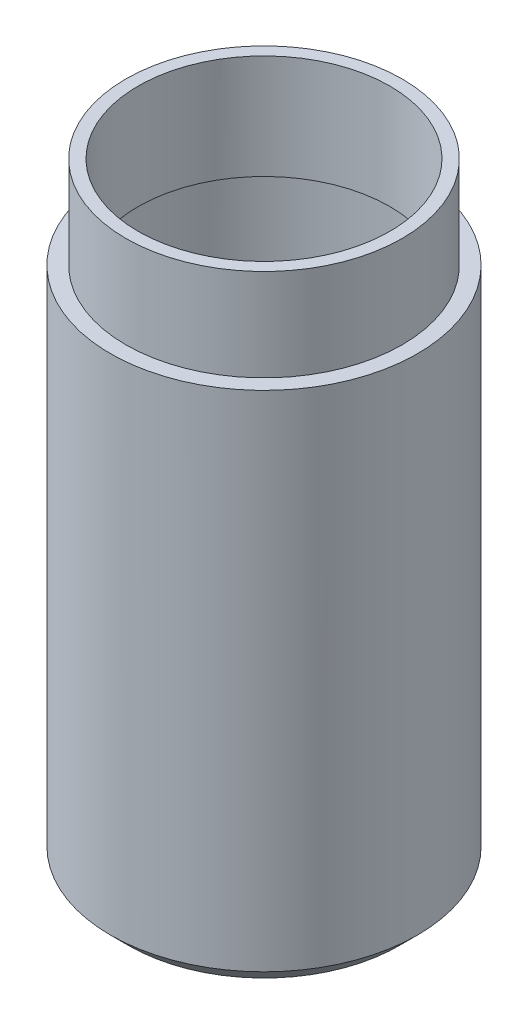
ISO-10303-21;
HEADER;
FILE_DESCRIPTION(('STEP AP214'),'2;1');
FILE_NAME('part.step','',(''),(''),'','','');
FILE_SCHEMA(('AUTOMOTIVE_DESIGN { 1 0 10303 214 1 1 1 1 }'));
ENDSEC;
DATA;
#1=APPLICATION_CONTEXT('core data for automotive mechanical design processes');
#2=APPLICATION_PROTOCOL_DEFINITION('international standard','automotive_design',2000,#1);
#3=PRODUCT_CONTEXT('',#1,'mechanical');
#4=PRODUCT('Part','Part','',(#3));
#5=PRODUCT_RELATED_PRODUCT_CATEGORY('part','',(#4));
#6=PRODUCT_DEFINITION_FORMATION('','',#4);
#7=PRODUCT_DEFINITION_CONTEXT('part definition',#1,'design');
#8=PRODUCT_DEFINITION('design','',#6,#7);
#9=PRODUCT_DEFINITION_SHAPE('','',#8);
#10=(LENGTH_UNIT() NAMED_UNIT(*) SI_UNIT(.MILLI.,.METRE.));
#11=(NAMED_UNIT(*) PLANE_ANGLE_UNIT() SI_UNIT($,.RADIAN.));
#12=(NAMED_UNIT(*) SI_UNIT($,.STERADIAN.) SOLID_ANGLE_UNIT());
#13=UNCERTAINTY_MEASURE_WITH_UNIT(LENGTH_MEASURE(1.E-05),#10,'distance_accuracy_value','');
#14=(GEOMETRIC_REPRESENTATION_CONTEXT(3) GLOBAL_UNCERTAINTY_ASSIGNED_CONTEXT((#13)) GLOBAL_UNIT_ASSIGNED_CONTEXT((#10,
#11,#12)) REPRESENTATION_CONTEXT('',''));
#15=CARTESIAN_POINT('',(0.,0.,0.));
#16=DIRECTION('',(0.,0.,1.));
#17=DIRECTION('',(1.,0.,0.));
#18=AXIS2_PLACEMENT_3D('',#15,#16,#17);
#19=CARTESIAN_POINT('',(0.,0.,0.));
#20=DIRECTION('',(0.,1.,0.));
#21=DIRECTION('',(0.,0.,1.));
#22=AXIS2_PLACEMENT_3D('',#19,#20,#21);
#23=PLANE('',#22);
#24=CARTESIAN_POINT('',(0.,0.,0.));
#25=DIRECTION('',(0.,1.,0.));
#26=DIRECTION('',(0.,0.,1.));
#27=AXIS2_PLACEMENT_3D('',#24,#25,#26);
#28=CIRCLE('',#27,22.);
#29=CARTESIAN_POINT('',(0.,0.,22.));
#30=VERTEX_POINT('',#29);
#31=EDGE_CURVE('E45',#30,#30,#28,.F.);
#32=ORIENTED_EDGE('',*,*,#31,.T.);
#33=EDGE_LOOP('',(#32));
#34=FACE_BOUND('',#33,.T.);
#35=ADVANCED_FACE('F37',(#34),#23,.F.);
#36=CARTESIAN_POINT('',(0.,265.002,0.));
#37=DIRECTION('',(0.,-1.,0.));
#38=DIRECTION('',(0.,0.,-1.));
#39=AXIS2_PLACEMENT_3D('',#36,#37,#38);
#40=CYLINDRICAL_SURFACE('',#39,25.);
#41=CARTESIAN_POINT('',(0.,85.,0.));
#42=DIRECTION('',(0.,-1.,0.));
#43=DIRECTION('',(0.,0.,-1.));
#44=AXIS2_PLACEMENT_3D('',#41,#42,#43);
#45=CIRCLE('',#44,25.);
#46=CARTESIAN_POINT('',(0.,85.,-25.));
#47=VERTEX_POINT('',#46);
#48=EDGE_CURVE('E41',#47,#47,#45,.T.);
#49=ORIENTED_EDGE('',*,*,#48,.T.);
#50=EDGE_LOOP('',(#49));
#51=FACE_BOUND('',#50,.T.);
#52=CARTESIAN_POINT('',(0.,3.00000000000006,0.));
#53=DIRECTION('',(0.,1.,0.));
#54=DIRECTION('',(0.,0.,1.));
#55=AXIS2_PLACEMENT_3D('',#52,#53,#54);
#56=CIRCLE('',#55,25.);
#57=CARTESIAN_POINT('',(0.,3.00000000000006,25.));
#58=VERTEX_POINT('',#57);
#59=EDGE_CURVE('E50',#58,#58,#56,.T.);
#60=ORIENTED_EDGE('',*,*,#59,.T.);
#61=EDGE_LOOP('',(#60));
#62=FACE_BOUND('',#61,.T.);
#63=ADVANCED_FACE('F107',(#51,#62),#40,.T.);
#64=CARTESIAN_POINT('',(0.,3.00000000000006,0.));
#65=DIRECTION('',(0.,1.,0.));
#66=DIRECTION('',(0.,0.,1.));
#67=AXIS2_PLACEMENT_3D('',#64,#65,#66);
#68=CONICAL_SURFACE('',#67,25.,0.785398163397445);
#69=ORIENTED_EDGE('',*,*,#31,.F.);
#70=EDGE_LOOP('',(#69));
#71=FACE_BOUND('',#70,.T.);
#72=ORIENTED_EDGE('',*,*,#59,.F.);
#73=EDGE_LOOP('',(#72));
#74=FACE_BOUND('',#73,.T.);
#75=ADVANCED_FACE('F39',(#71,#74),#68,.T.);
#76=CARTESIAN_POINT('',(0.,85.,0.));
#77=DIRECTION('',(0.,-1.,0.));
#78=DIRECTION('',(0.,0.,-1.));
#79=AXIS2_PLACEMENT_3D('',#76,#77,#78);
#80=PLANE('',#79);
#81=CARTESIAN_POINT('',(0.,85.,0.));
#82=DIRECTION('',(0.,1.,0.));
#83=DIRECTION('',(0.,0.,1.));
#84=AXIS2_PLACEMENT_3D('',#81,#82,#83);
#85=CIRCLE('',#84,22.5);
#86=CARTESIAN_POINT('',(0.,85.,22.5));
#87=VERTEX_POINT('',#86);
#88=EDGE_CURVE('E10',#87,#87,#85,.T.);
#89=ORIENTED_EDGE('',*,*,#88,.F.);
#90=EDGE_LOOP('',(#89));
#91=FACE_BOUND('',#90,.T.);
#92=ORIENTED_EDGE('',*,*,#48,.F.);
#93=EDGE_LOOP('',(#92));
#94=FACE_BOUND('',#93,.T.);
#95=ADVANCED_FACE('F113',(#91,#94),#80,.F.);
#96=CARTESIAN_POINT('',(0.,100.,0.));
#97=DIRECTION('',(0.,-1.,0.));
#98=DIRECTION('',(0.,0.,-1.));
#99=AXIS2_PLACEMENT_3D('',#96,#97,#98);
#100=CYLINDRICAL_SURFACE('',#99,22.5);
#101=CARTESIAN_POINT('',(0.,100.,0.));
#102=DIRECTION('',(0.,1.,0.));
#103=DIRECTION('',(0.,0.,1.));
#104=AXIS2_PLACEMENT_3D('',#101,#102,#103);
#105=CIRCLE('',#104,22.5);
#106=CARTESIAN_POINT('',(0.,100.,22.5));
#107=VERTEX_POINT('',#106);
#108=EDGE_CURVE('E53',#107,#107,#105,.T.);
#109=ORIENTED_EDGE('',*,*,#108,.F.);
#110=EDGE_LOOP('',(#109));
#111=FACE_BOUND('',#110,.T.);
#112=ORIENTED_EDGE('',*,*,#88,.T.);
#113=EDGE_LOOP('',(#112));
#114=FACE_BOUND('',#113,.T.);
#115=ADVANCED_FACE('F104',(#111,#114),#100,.T.);
#116=CARTESIAN_POINT('',(0.,100.,0.));
#117=DIRECTION('',(0.,1.,0.));
#118=DIRECTION('',(0.,0.,1.));
#119=AXIS2_PLACEMENT_3D('',#116,#117,#118);
#120=PLANE('',#119);
#121=CARTESIAN_POINT('',(0.,100.,0.));
#122=DIRECTION('',(0.,1.,0.));
#123=DIRECTION('',(0.,0.,1.));
#124=AXIS2_PLACEMENT_3D('',#121,#122,#123);
#125=CIRCLE('',#124,20.5);
#126=CARTESIAN_POINT('',(0.,100.,20.5));
#127=VERTEX_POINT('',#126);
#128=EDGE_CURVE('E76',#127,#127,#125,.T.);
#129=ORIENTED_EDGE('',*,*,#128,.F.);
#130=EDGE_LOOP('',(#129));
#131=FACE_BOUND('',#130,.T.);
#132=ORIENTED_EDGE('',*,*,#108,.T.);
#133=EDGE_LOOP('',(#132));
#134=FACE_BOUND('',#133,.T.);
#135=ADVANCED_FACE('F93',(#131,#134),#120,.T.);
#136=CARTESIAN_POINT('',(0.,2.,0.));
#137=DIRECTION('',(0.,1.,0.));
#138=DIRECTION('',(0.,0.,1.));
#139=AXIS2_PLACEMENT_3D('',#136,#137,#138);
#140=PLANE('',#139);
#141=CARTESIAN_POINT('',(0.,2.,0.));
#142=DIRECTION('',(0.,1.,0.));
#143=DIRECTION('',(0.,0.,1.));
#144=AXIS2_PLACEMENT_3D('',#141,#142,#143);
#145=CIRCLE('',#144,21.1715728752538);
#146=CARTESIAN_POINT('',(0.,2.,21.1715728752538));
#147=VERTEX_POINT('',#146);
#148=EDGE_CURVE('E66',#147,#147,#145,.F.);
#149=ORIENTED_EDGE('',*,*,#148,.F.);
#150=EDGE_LOOP('',(#149));
#151=FACE_BOUND('',#150,.T.);
#152=ADVANCED_FACE('F90',(#151),#140,.T.);
#153=CARTESIAN_POINT('',(0.,265.002,0.));
#154=DIRECTION('',(0.,-1.,0.));
#155=DIRECTION('',(0.,0.,-1.));
#156=AXIS2_PLACEMENT_3D('',#153,#154,#155);
#157=CYLINDRICAL_SURFACE('',#156,23.);
#158=CARTESIAN_POINT('',(0.,83.,0.));
#159=DIRECTION('',(0.,-1.,0.));
#160=DIRECTION('',(0.,0.,-1.));
#161=AXIS2_PLACEMENT_3D('',#158,#159,#160);
#162=CIRCLE('',#161,23.);
#163=CARTESIAN_POINT('',(0.,83.,-23.));
#164=VERTEX_POINT('',#163);
#165=EDGE_CURVE('E74',#164,#164,#162,.T.);
#166=ORIENTED_EDGE('',*,*,#165,.F.);
#167=EDGE_LOOP('',(#166));
#168=FACE_BOUND('',#167,.T.);
#169=CARTESIAN_POINT('',(0.,3.82842712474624,0.));
#170=DIRECTION('',(0.,1.,0.));
#171=DIRECTION('',(0.,0.,1.));
#172=AXIS2_PLACEMENT_3D('',#169,#170,#171);
#173=CIRCLE('',#172,23.);
#174=CARTESIAN_POINT('',(0.,3.82842712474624,23.));
#175=VERTEX_POINT('',#174);
#176=EDGE_CURVE('E71',#175,#175,#173,.T.);
#177=ORIENTED_EDGE('',*,*,#176,.F.);
#178=EDGE_LOOP('',(#177));
#179=FACE_BOUND('',#178,.T.);
#180=ADVANCED_FACE('F88',(#168,#179),#157,.F.);
#181=CARTESIAN_POINT('',(0.,4.41421356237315,0.));
#182=DIRECTION('',(0.,1.,0.));
#183=DIRECTION('',(0.,0.,1.));
#184=AXIS2_PLACEMENT_3D('',#181,#182,#183);
#185=CONICAL_SURFACE('',#184,23.5857864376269,0.785398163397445);
#186=ORIENTED_EDGE('',*,*,#148,.T.);
#187=EDGE_LOOP('',(#186));
#188=FACE_BOUND('',#187,.T.);
#189=ORIENTED_EDGE('',*,*,#176,.T.);
#190=EDGE_LOOP('',(#189));
#191=FACE_BOUND('',#190,.T.);
#192=ADVANCED_FACE('F86',(#188,#191),#185,.F.);
#193=CARTESIAN_POINT('',(0.,83.,0.));
#194=DIRECTION('',(0.,-1.,0.));
#195=DIRECTION('',(0.,0.,-1.));
#196=AXIS2_PLACEMENT_3D('',#193,#194,#195);
#197=PLANE('',#196);
#198=CARTESIAN_POINT('',(0.,83.,0.));
#199=DIRECTION('',(0.,-1.,0.));
#200=DIRECTION('',(0.,0.,-1.));
#201=AXIS2_PLACEMENT_3D('',#198,#199,#200);
#202=CIRCLE('',#201,20.5);
#203=CARTESIAN_POINT('',(0.,83.,-20.5));
#204=VERTEX_POINT('',#203);
#205=EDGE_CURVE('E62',#204,#204,#202,.F.);
#206=ORIENTED_EDGE('',*,*,#205,.T.);
#207=EDGE_LOOP('',(#206));
#208=FACE_BOUND('',#207,.T.);
#209=ORIENTED_EDGE('',*,*,#165,.T.);
#210=EDGE_LOOP('',(#209));
#211=FACE_BOUND('',#210,.T.);
#212=ADVANCED_FACE('F98',(#208,#211),#197,.T.);
#213=CARTESIAN_POINT('',(0.,100.,0.));
#214=DIRECTION('',(0.,-1.,0.));
#215=DIRECTION('',(0.,0.,-1.));
#216=AXIS2_PLACEMENT_3D('',#213,#214,#215);
#217=CYLINDRICAL_SURFACE('',#216,20.5);
#218=ORIENTED_EDGE('',*,*,#128,.T.);
#219=EDGE_LOOP('',(#218));
#220=FACE_BOUND('',#219,.T.);
#221=ORIENTED_EDGE('',*,*,#205,.F.);
#222=EDGE_LOOP('',(#221));
#223=FACE_BOUND('',#222,.T.);
#224=ADVANCED_FACE('F124',(#220,#223),#217,.F.);
#225=CLOSED_SHELL('',(#35,#63,#75,#95,#115,#135,#152,#180,#192,#212,#224));
#226=MANIFOLD_SOLID_BREP('B2',#225);
#227=ADVANCED_BREP_SHAPE_REPRESENTATION('',(#18,#226),#14);
#228=SHAPE_DEFINITION_REPRESENTATION(#9,#227);
ENDSEC;
END-ISO-10303-21;
